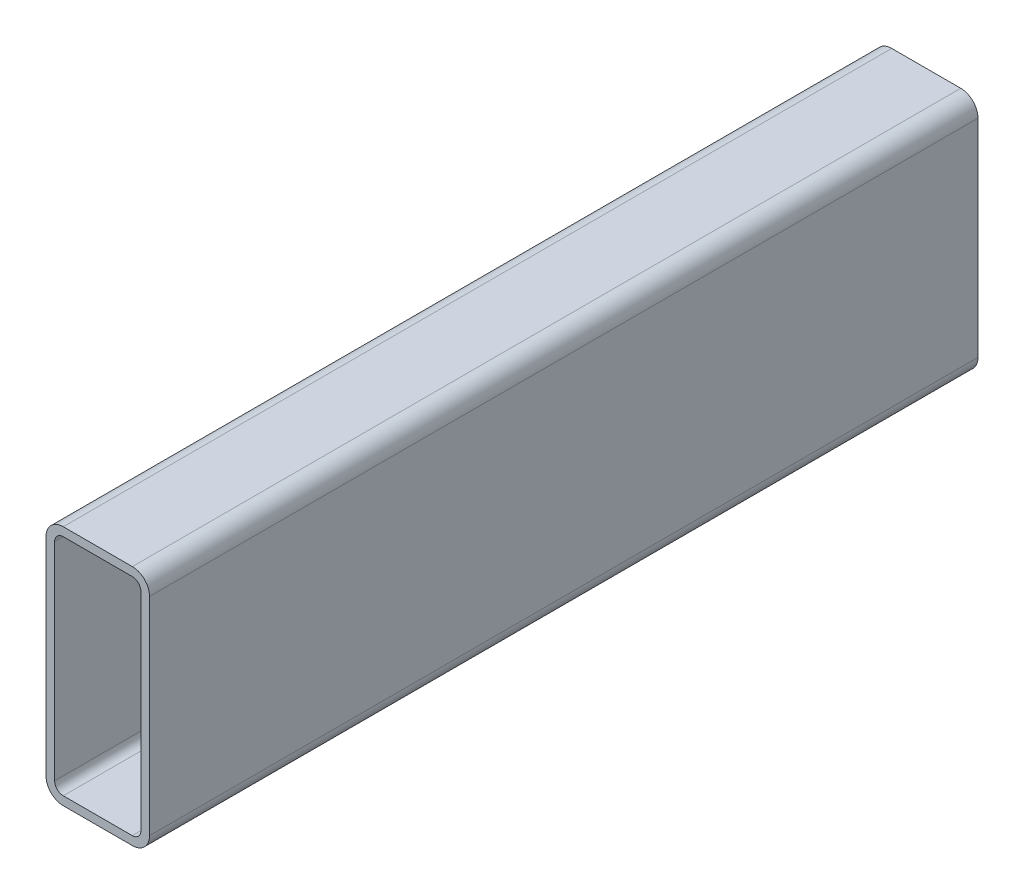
from build123d import *

# Parameters (mm, degrees)
BOSS_EXTRUDE1_DEPTH = 304.8


with BuildPart() as part:
    # Sketch1 → Boss-Extrude1 (new body)
    with BuildSketch(Plane.XY):
        with BuildLine():
            Line((6.35, 88.9), (31.75, 88.9))
            ThreePointArc((31.75, 88.9), (36.240128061, 87.040128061), (38.1, 82.55))
            Line((38.1, 82.55), (38.1, 6.35))
            ThreePointArc((38.1, 6.35), (36.240128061, 1.859871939), (31.75, 0))
            Line((31.75, 0), (6.35, 0))
            ThreePointArc((6.35, 0), (1.859871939, 1.859871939), (0, 6.35))
            Line((0, 6.35), (0, 82.55))
            ThreePointArc((0, 82.55), (1.859871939, 87.040128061), (6.35, 88.9))
        make_face()
        with BuildLine():
            Line((6.35, 85.725), (31.75, 85.725))
            ThreePointArc((31.75, 85.725), (33.99506403, 84.79506403), (34.925, 82.55))
            Line((34.925, 82.55), (34.925, 6.35))
            ThreePointArc((34.925, 6.35), (33.99506403, 4.10493597), (31.75, 3.175))
            Line((31.75, 3.175), (6.35, 3.175))
            ThreePointArc((6.35, 3.175), (4.10493597, 4.10493597), (3.175, 6.35))
            Line((3.175, 6.35), (3.175, 82.55))
            ThreePointArc((3.175, 82.55), (4.10493597, 84.79506403), (6.35, 85.725))
        make_face(mode=Mode.SUBTRACT)
    extrude(amount=BOSS_EXTRUDE1_DEPTH)


solid = part.part
